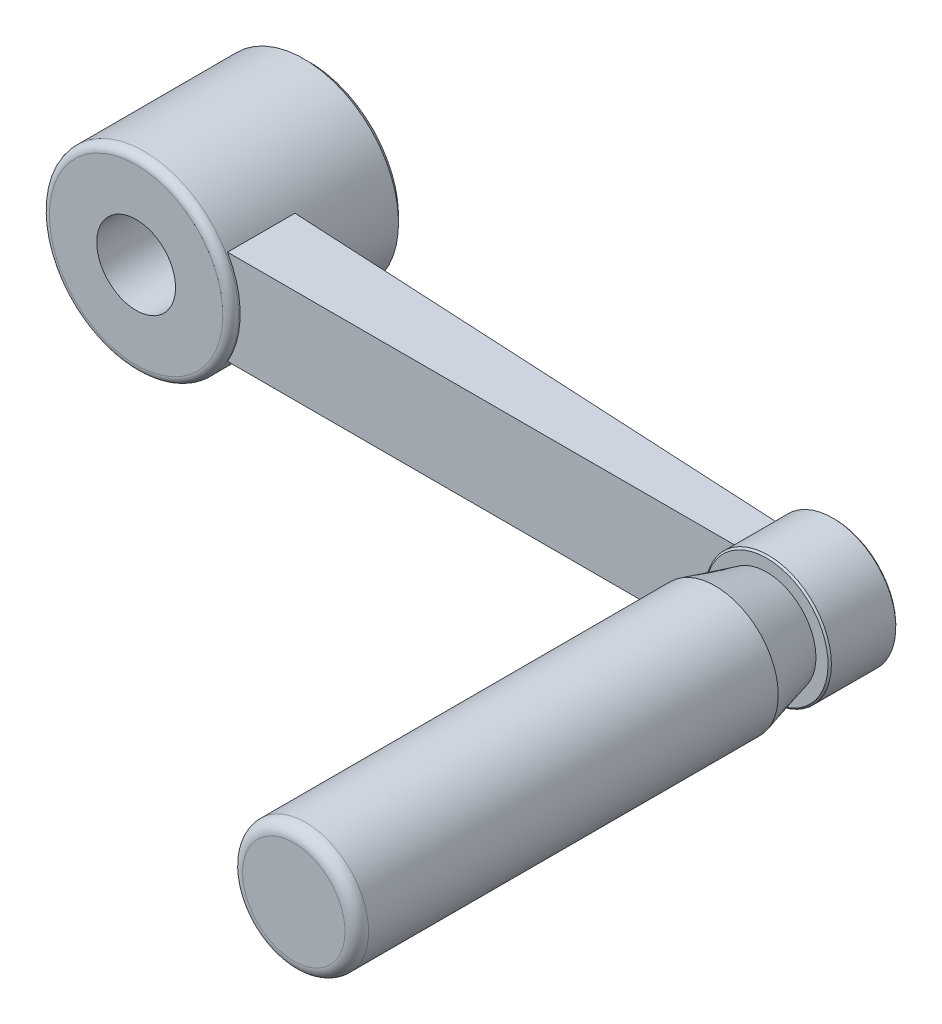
ISO-10303-21;
HEADER;
FILE_DESCRIPTION(('STEP AP214'),'2;1');
FILE_NAME('part.step','',(''),(''),'','','');
FILE_SCHEMA(('AUTOMOTIVE_DESIGN { 1 0 10303 214 1 1 1 1 }'));
ENDSEC;
DATA;
#1=APPLICATION_CONTEXT('core data for automotive mechanical design processes');
#2=APPLICATION_PROTOCOL_DEFINITION('international standard','automotive_design',2000,#1);
#3=PRODUCT_CONTEXT('',#1,'mechanical');
#4=PRODUCT('Part','Part','',(#3));
#5=PRODUCT_RELATED_PRODUCT_CATEGORY('part','',(#4));
#6=PRODUCT_DEFINITION_FORMATION('','',#4);
#7=PRODUCT_DEFINITION_CONTEXT('part definition',#1,'design');
#8=PRODUCT_DEFINITION('design','',#6,#7);
#9=PRODUCT_DEFINITION_SHAPE('','',#8);
#10=(LENGTH_UNIT() NAMED_UNIT(*) SI_UNIT(.MILLI.,.METRE.));
#11=(NAMED_UNIT(*) PLANE_ANGLE_UNIT() SI_UNIT($,.RADIAN.));
#12=(NAMED_UNIT(*) SI_UNIT($,.STERADIAN.) SOLID_ANGLE_UNIT());
#13=UNCERTAINTY_MEASURE_WITH_UNIT(LENGTH_MEASURE(1.E-05),#10,'distance_accuracy_value','');
#14=(GEOMETRIC_REPRESENTATION_CONTEXT(3) GLOBAL_UNCERTAINTY_ASSIGNED_CONTEXT((#13)) GLOBAL_UNIT_ASSIGNED_CONTEXT((#10,
#11,#12)) REPRESENTATION_CONTEXT('',''));
#15=CARTESIAN_POINT('',(0.,0.,0.));
#16=DIRECTION('',(0.,0.,1.));
#17=DIRECTION('',(1.,0.,0.));
#18=AXIS2_PLACEMENT_3D('',#15,#16,#17);
#19=CARTESIAN_POINT('',(82.0095,0.,14.));
#20=DIRECTION('',(0.,0.,1.));
#21=DIRECTION('',(0.,-1.,0.));
#22=AXIS2_PLACEMENT_3D('',#19,#20,#21);
#23=PLANE('',#22);
#24=CARTESIAN_POINT('',(80.,0.,14.00000000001));
#25=DIRECTION('',(0.,0.,1.));
#26=DIRECTION('',(-1.,0.,0.));
#27=AXIS2_PLACEMENT_3D('',#24,#25,#26);
#28=CIRCLE('',#27,2.00949999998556);
#29=CARTESIAN_POINT('',(77.9905000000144,0.,14.00000000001));
#30=VERTEX_POINT('',#29);
#31=EDGE_CURVE('E17',#30,#30,#28,.T.);
#32=ORIENTED_EDGE('',*,*,#31,.F.);
#33=EDGE_LOOP('',(#32));
#34=FACE_BOUND('',#33,.T.);
#35=ADVANCED_FACE('F14',(#34),#23,.F.);
#36=CARTESIAN_POINT('',(80.,0.,14.0574999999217));
#37=DIRECTION('',(0.,0.,1.));
#38=DIRECTION('',(-1.,0.,0.));
#39=AXIS2_PLACEMENT_3D('',#36,#37,#38);
#40=CONICAL_SURFACE('',#39,2.06699999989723,0.785398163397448);
#41=CARTESIAN_POINT('',(80.,0.,14.0575));
#42=DIRECTION('',(0.,0.,1.));
#43=DIRECTION('',(0.,-1.,0.));
#44=AXIS2_PLACEMENT_3D('',#41,#42,#43);
#45=CIRCLE('',#44,2.067);
#46=CARTESIAN_POINT('',(80.,-2.067,14.0575));
#47=VERTEX_POINT('',#46);
#48=EDGE_CURVE('E117',#47,#47,#45,.F.);
#49=ORIENTED_EDGE('',*,*,#48,.T.);
#50=EDGE_LOOP('',(#49));
#51=FACE_BOUND('',#50,.T.);
#52=ORIENTED_EDGE('',*,*,#31,.T.);
#53=EDGE_LOOP('',(#52));
#54=FACE_BOUND('',#53,.T.);
#55=ADVANCED_FACE('F429',(#51,#54),#40,.T.);
#56=CARTESIAN_POINT('',(0.,0.,0.));
#57=DIRECTION('',(0.,0.,1.));
#58=DIRECTION('',(0.,-1.,0.));
#59=AXIS2_PLACEMENT_3D('',#56,#57,#58);
#60=CYLINDRICAL_SURFACE('',#59,5.);
#61=CARTESIAN_POINT('',(0.,0.,22.));
#62=DIRECTION('',(0.,0.,1.));
#63=DIRECTION('',(0.,-1.,0.));
#64=AXIS2_PLACEMENT_3D('',#61,#62,#63);
#65=CIRCLE('',#64,5.);
#66=CARTESIAN_POINT('',(0.,-5.,22.));
#67=VERTEX_POINT('',#66);
#68=EDGE_CURVE('E152',#67,#67,#65,.T.);
#69=ORIENTED_EDGE('',*,*,#68,.T.);
#70=EDGE_LOOP('',(#69));
#71=FACE_BOUND('',#70,.T.);
#72=CARTESIAN_POINT('',(0.,0.,0.));
#73=DIRECTION('',(0.,0.,1.));
#74=DIRECTION('',(0.,-1.,0.));
#75=AXIS2_PLACEMENT_3D('',#72,#73,#74);
#76=CIRCLE('',#75,5.);
#77=CARTESIAN_POINT('',(0.,-5.,0.));
#78=VERTEX_POINT('',#77);
#79=EDGE_CURVE('E125',#78,#78,#76,.F.);
#80=ORIENTED_EDGE('',*,*,#79,.T.);
#81=EDGE_LOOP('',(#80));
#82=FACE_BOUND('',#81,.T.);
#83=ADVANCED_FACE('F157',(#71,#82),#60,.F.);
#84=CARTESIAN_POINT('',(80.,0.,13.4));
#85=DIRECTION('',(0.,0.,1.));
#86=DIRECTION('',(0.,-1.,0.));
#87=AXIS2_PLACEMENT_3D('',#84,#85,#86);
#88=CYLINDRICAL_SURFACE('',#87,2.067);
#89=ORIENTED_EDGE('',*,*,#48,.F.);
#90=EDGE_LOOP('',(#89));
#91=FACE_BOUND('',#90,.T.);
#92=CARTESIAN_POINT('',(80.,0.,13.8329999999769));
#93=DIRECTION('',(0.,0.,-1.));
#94=DIRECTION('',(0.,1.,0.));
#95=AXIS2_PLACEMENT_3D('',#92,#93,#94);
#96=CIRCLE('',#95,2.06699999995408);
#97=CARTESIAN_POINT('',(80.,2.06699999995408,13.8329999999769));
#98=VERTEX_POINT('',#97);
#99=EDGE_CURVE('E97',#98,#98,#96,.T.);
#100=ORIENTED_EDGE('',*,*,#99,.T.);
#101=EDGE_LOOP('',(#100));
#102=FACE_BOUND('',#101,.T.);
#103=ADVANCED_FACE('F162',(#91,#102),#88,.F.);
#104=CARTESIAN_POINT('',(11.2928932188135,0.,0.));
#105=DIRECTION('',(0.,0.,1.));
#106=DIRECTION('',(0.,-1.,0.));
#107=AXIS2_PLACEMENT_3D('',#104,#105,#106);
#108=PLANE('',#107);
#109=CARTESIAN_POINT('',(0.,0.,0.));
#110=DIRECTION('',(0.,0.,1.));
#111=DIRECTION('',(0.,-1.,0.));
#112=AXIS2_PLACEMENT_3D('',#109,#110,#111);
#113=CIRCLE('',#112,11.2928932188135);
#114=CARTESIAN_POINT('',(0.,-11.2928932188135,0.));
#115=VERTEX_POINT('',#114);
#116=EDGE_CURVE('E149',#115,#115,#113,.T.);
#117=ORIENTED_EDGE('',*,*,#116,.F.);
#118=EDGE_LOOP('',(#117));
#119=FACE_BOUND('',#118,.T.);
#120=ORIENTED_EDGE('',*,*,#79,.F.);
#121=EDGE_LOOP('',(#120));
#122=FACE_BOUND('',#121,.T.);
#123=ADVANCED_FACE('F159',(#119,#122),#108,.F.);
#124=CARTESIAN_POINT('',(0.,0.,22.));
#125=DIRECTION('',(0.,0.,-1.));
#126=DIRECTION('',(0.,1.,0.));
#127=AXIS2_PLACEMENT_3D('',#124,#125,#126);
#128=PLANE('',#127);
#129=ORIENTED_EDGE('',*,*,#68,.F.);
#130=EDGE_LOOP('',(#129));
#131=FACE_BOUND('',#130,.T.);
#132=CARTESIAN_POINT('',(0.,0.,22.));
#133=DIRECTION('',(0.,0.,-1.));
#134=DIRECTION('',(0.,1.,0.));
#135=AXIS2_PLACEMENT_3D('',#132,#133,#134);
#136=CIRCLE('',#135,11.);
#137=CARTESIAN_POINT('',(0.,11.,22.));
#138=VERTEX_POINT('',#137);
#139=EDGE_CURVE('E148',#138,#138,#136,.T.);
#140=ORIENTED_EDGE('',*,*,#139,.F.);
#141=EDGE_LOOP('',(#140));
#142=FACE_BOUND('',#141,.T.);
#143=ADVANCED_FACE('F161',(#131,#142),#128,.F.);
#144=CARTESIAN_POINT('',(80.,0.,13.4000000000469));
#145=DIRECTION('',(0.,0.,-1.));
#146=DIRECTION('',(1.,0.,0.));
#147=AXIS2_PLACEMENT_3D('',#144,#145,#146);
#148=CONICAL_SURFACE('',#147,2.49999999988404,0.78539816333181);
#149=ORIENTED_EDGE('',*,*,#99,.F.);
#150=EDGE_LOOP('',(#149));
#151=FACE_BOUND('',#150,.T.);
#152=CARTESIAN_POINT('',(80.,0.,13.3999999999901));
#153=DIRECTION('',(0.,0.,-1.));
#154=DIRECTION('',(1.,0.,0.));
#155=AXIS2_PLACEMENT_3D('',#152,#153,#154);
#156=CIRCLE('',#155,2.49999999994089);
#157=CARTESIAN_POINT('',(82.4999999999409,0.,13.3999999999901));
#158=VERTEX_POINT('',#157);
#159=EDGE_CURVE('E92',#158,#158,#156,.F.);
#160=ORIENTED_EDGE('',*,*,#159,.F.);
#161=EDGE_LOOP('',(#160));
#162=FACE_BOUND('',#161,.T.);
#163=ADVANCED_FACE('F170',(#151,#162),#148,.F.);
#164=CARTESIAN_POINT('',(0.,0.,0.707106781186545));
#165=DIRECTION('',(0.,0.,1.));
#166=DIRECTION('',(0.,-1.,0.));
#167=AXIS2_PLACEMENT_3D('',#164,#165,#166);
#168=CONICAL_SURFACE('',#167,12.,0.785398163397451);
#169=CARTESIAN_POINT('',(0.,0.,0.707106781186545));
#170=DIRECTION('',(0.,0.,1.));
#171=DIRECTION('',(0.,-1.,0.));
#172=AXIS2_PLACEMENT_3D('',#169,#170,#171);
#173=CIRCLE('',#172,12.);
#174=CARTESIAN_POINT('',(0.,-12.,0.707106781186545));
#175=VERTEX_POINT('',#174);
#176=EDGE_CURVE('E87',#175,#175,#173,.T.);
#177=ORIENTED_EDGE('',*,*,#176,.F.);
#178=EDGE_LOOP('',(#177));
#179=FACE_BOUND('',#178,.T.);
#180=ORIENTED_EDGE('',*,*,#116,.T.);
#181=EDGE_LOOP('',(#180));
#182=FACE_BOUND('',#181,.T.);
#183=ADVANCED_FACE('F106',(#179,#182),#168,.T.);
#184=CARTESIAN_POINT('',(0.,0.,21.));
#185=DIRECTION('',(0.,0.,-1.));
#186=DIRECTION('',(0.,1.,0.));
#187=AXIS2_PLACEMENT_3D('',#184,#185,#186);
#188=TOROIDAL_SURFACE('',#187,11.,1.);
#189=CARTESIAN_POINT('',(0.,0.,21.));
#190=DIRECTION('',(0.,0.,1.));
#191=DIRECTION('',(0.,-1.,0.));
#192=AXIS2_PLACEMENT_3D('',#189,#190,#191);
#193=CIRCLE('',#192,12.);
#194=CARTESIAN_POINT('',(0.,-12.,21.));
#195=VERTEX_POINT('',#194);
#196=EDGE_CURVE('E84',#195,#195,#193,.F.);
#197=ORIENTED_EDGE('',*,*,#196,.F.);
#198=EDGE_LOOP('',(#197));
#199=FACE_BOUND('',#198,.T.);
#200=ORIENTED_EDGE('',*,*,#139,.T.);
#201=EDGE_LOOP('',(#200));
#202=FACE_BOUND('',#201,.T.);
#203=ADVANCED_FACE('F100',(#199,#202),#188,.T.);
#204=CARTESIAN_POINT('',(82.5,0.,13.4));
#205=DIRECTION('',(0.,0.,-1.));
#206=DIRECTION('',(0.,1.,0.));
#207=AXIS2_PLACEMENT_3D('',#204,#205,#206);
#208=PLANE('',#207);
#209=ORIENTED_EDGE('',*,*,#159,.T.);
#210=EDGE_LOOP('',(#209));
#211=FACE_BOUND('',#210,.T.);
#212=CARTESIAN_POINT('',(80.,0.,13.4));
#213=DIRECTION('',(0.,0.,1.));
#214=DIRECTION('',(-1.,0.,0.));
#215=AXIS2_PLACEMENT_3D('',#212,#213,#214);
#216=CIRCLE('',#215,7.78786796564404);
#217=CARTESIAN_POINT('',(72.212132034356,0.,13.4));
#218=VERTEX_POINT('',#217);
#219=EDGE_CURVE('E63',#218,#218,#216,.T.);
#220=ORIENTED_EDGE('',*,*,#219,.F.);
#221=EDGE_LOOP('',(#220));
#222=FACE_BOUND('',#221,.T.);
#223=ADVANCED_FACE('F105',(#211,#222),#208,.T.);
#224=CARTESIAN_POINT('',(0.,0.,0.));
#225=DIRECTION('',(0.,0.,1.));
#226=DIRECTION('',(0.,-1.,0.));
#227=AXIS2_PLACEMENT_3D('',#224,#225,#226);
#228=CYLINDRICAL_SURFACE('',#227,12.);
#229=ORIENTED_EDGE('',*,*,#196,.T.);
#230=EDGE_LOOP('',(#229));
#231=FACE_BOUND('',#230,.T.);
#232=CARTESIAN_POINT('',(0.,0.,11.7));
#233=DIRECTION('',(-0.0523359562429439,0.,0.998629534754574));
#234=DIRECTION('',(0.998629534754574,0.,0.0523359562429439));
#235=AXIS2_PLACEMENT_3D('',#232,#233,#234);
#236=ELLIPSE('',#235,12.016468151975,12.);
#237=CARTESIAN_POINT('',(10.3923048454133,6.,12.2446376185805));
#238=VERTEX_POINT('',#237);
#239=CARTESIAN_POINT('',(10.3923048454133,-6.,12.2446376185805));
#240=VERTEX_POINT('',#239);
#241=EDGE_CURVE('E53',#238,#240,#236,.F.);
#242=ORIENTED_EDGE('',*,*,#241,.T.);
#243=DIRECTION('',(0.,0.,1.));
#244=VECTOR('',#243,1.);
#245=CARTESIAN_POINT('',(10.3923048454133,-6.,0.));
#246=LINE('',#245,#244);
#247=CARTESIAN_POINT('',(10.3923048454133,-6.,20.8));
#248=VERTEX_POINT('',#247);
#249=EDGE_CURVE('E82',#240,#248,#246,.T.);
#250=ORIENTED_EDGE('',*,*,#249,.T.);
#251=CARTESIAN_POINT('',(0.,0.,20.8));
#252=DIRECTION('',(0.,0.,1.));
#253=DIRECTION('',(0.,-1.,0.));
#254=AXIS2_PLACEMENT_3D('',#251,#252,#253);
#255=CIRCLE('',#254,12.);
#256=CARTESIAN_POINT('',(10.3923048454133,6.,20.8));
#257=VERTEX_POINT('',#256);
#258=EDGE_CURVE('E69',#248,#257,#255,.T.);
#259=ORIENTED_EDGE('',*,*,#258,.T.);
#260=DIRECTION('',(0.,0.,1.));
#261=VECTOR('',#260,1.);
#262=CARTESIAN_POINT('',(10.3923048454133,6.,0.));
#263=LINE('',#262,#261);
#264=EDGE_CURVE('E66',#238,#257,#263,.T.);
#265=ORIENTED_EDGE('',*,*,#264,.F.);
#266=EDGE_LOOP('',(#242,#250,#259,#265));
#267=FACE_BOUND('',#266,.T.);
#268=ORIENTED_EDGE('',*,*,#176,.T.);
#269=EDGE_LOOP('',(#268));
#270=FACE_BOUND('',#269,.T.);
#271=ADVANCED_FACE('F67',(#231,#267,#270),#228,.T.);
#272=CARTESIAN_POINT('',(80.,0.,13.612132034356));
#273=DIRECTION('',(0.,0.,1.));
#274=DIRECTION('',(-1.,0.,0.));
#275=AXIS2_PLACEMENT_3D('',#272,#273,#274);
#276=CONICAL_SURFACE('',#275,8.,0.785398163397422);
#277=ORIENTED_EDGE('',*,*,#219,.T.);
#278=EDGE_LOOP('',(#277));
#279=FACE_BOUND('',#278,.T.);
#280=CARTESIAN_POINT('',(80.,0.,13.612132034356));
#281=DIRECTION('',(0.,0.,1.));
#282=DIRECTION('',(0.,-1.,0.));
#283=AXIS2_PLACEMENT_3D('',#280,#281,#282);
#284=CIRCLE('',#283,8.);
#285=CARTESIAN_POINT('',(80.,-8.,13.612132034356));
#286=VERTEX_POINT('',#285);
#287=EDGE_CURVE('E142',#286,#286,#284,.T.);
#288=ORIENTED_EDGE('',*,*,#287,.F.);
#289=EDGE_LOOP('',(#288));
#290=FACE_BOUND('',#289,.T.);
#291=ADVANCED_FACE('F237',(#279,#290),#276,.T.);
#292=CARTESIAN_POINT('',(0.,-6.,11.7));
#293=DIRECTION('',(-0.0523359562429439,0.,0.998629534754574));
#294=DIRECTION('',(-0.998629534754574,0.,-0.0523359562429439));
#295=AXIS2_PLACEMENT_3D('',#292,#293,#294);
#296=PLANE('',#295);
#297=CARTESIAN_POINT('',(80.,0.,15.8926223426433));
#298=DIRECTION('',(-0.0523359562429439,0.,0.998629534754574));
#299=DIRECTION('',(0.998629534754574,0.,0.0523359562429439));
#300=AXIS2_PLACEMENT_3D('',#297,#298,#299);
#301=ELLIPSE('',#300,8.01097876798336,8.);
#302=CARTESIAN_POINT('',(74.7084973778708,-6.,15.6153064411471));
#303=VERTEX_POINT('',#302);
#304=CARTESIAN_POINT('',(74.7084973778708,6.,15.6153064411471));
#305=VERTEX_POINT('',#304);
#306=EDGE_CURVE('E140',#303,#305,#301,.F.);
#307=ORIENTED_EDGE('',*,*,#306,.F.);
#308=DIRECTION('',(-0.998629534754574,0.,-0.0523359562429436));
#309=VECTOR('',#308,1.);
#310=CARTESIAN_POINT('',(74.7084973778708,-6.,15.6153064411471));
#311=LINE('',#310,#309);
#312=EDGE_CURVE('E60',#303,#240,#311,.T.);
#313=ORIENTED_EDGE('',*,*,#312,.T.);
#314=ORIENTED_EDGE('',*,*,#241,.F.);
#315=DIRECTION('',(-0.998629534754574,0.,-0.0523359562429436));
#316=VECTOR('',#315,1.);
#317=CARTESIAN_POINT('',(74.7084973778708,6.,15.6153064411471));
#318=LINE('',#317,#316);
#319=EDGE_CURVE('E57',#305,#238,#318,.T.);
#320=ORIENTED_EDGE('',*,*,#319,.F.);
#321=EDGE_LOOP('',(#307,#313,#314,#320));
#322=FACE_BOUND('',#321,.T.);
#323=ADVANCED_FACE('F55',(#322),#296,.F.);
#324=CARTESIAN_POINT('',(0.,6.,0.));
#325=DIRECTION('',(0.,1.,0.));
#326=DIRECTION('',(-1.,0.,0.));
#327=AXIS2_PLACEMENT_3D('',#324,#325,#326);
#328=PLANE('',#327);
#329=ORIENTED_EDGE('',*,*,#264,.T.);
#330=DIRECTION('',(1.,0.,0.));
#331=VECTOR('',#330,1.);
#332=CARTESIAN_POINT('',(76.5,6.,20.8));
#333=LINE('',#332,#331);
#334=CARTESIAN_POINT('',(74.7084973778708,6.,20.8));
#335=VERTEX_POINT('',#334);
#336=EDGE_CURVE('E80',#257,#335,#333,.T.);
#337=ORIENTED_EDGE('',*,*,#336,.T.);
#338=DIRECTION('',(0.,0.,1.));
#339=VECTOR('',#338,1.);
#340=CARTESIAN_POINT('',(74.7084973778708,6.,13.4));
#341=LINE('',#340,#339);
#342=EDGE_CURVE('E75',#305,#335,#341,.T.);
#343=ORIENTED_EDGE('',*,*,#342,.F.);
#344=ORIENTED_EDGE('',*,*,#319,.T.);
#345=EDGE_LOOP('',(#329,#337,#343,#344));
#346=FACE_BOUND('',#345,.T.);
#347=ADVANCED_FACE('F73',(#346),#328,.T.);
#348=CARTESIAN_POINT('',(76.5,-6.,20.8));
#349=DIRECTION('',(0.,0.,-1.));
#350=DIRECTION('',(0.,1.,0.));
#351=AXIS2_PLACEMENT_3D('',#348,#349,#350);
#352=PLANE('',#351);
#353=CARTESIAN_POINT('',(80.,0.,20.8));
#354=DIRECTION('',(0.,0.,1.));
#355=DIRECTION('',(0.,-1.,0.));
#356=AXIS2_PLACEMENT_3D('',#353,#354,#355);
#357=CIRCLE('',#356,8.);
#358=CARTESIAN_POINT('',(74.7084973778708,-6.,20.8));
#359=VERTEX_POINT('',#358);
#360=EDGE_CURVE('E136',#335,#359,#357,.T.);
#361=ORIENTED_EDGE('',*,*,#360,.F.);
#362=ORIENTED_EDGE('',*,*,#336,.F.);
#363=ORIENTED_EDGE('',*,*,#258,.F.);
#364=DIRECTION('',(-1.,0.,0.));
#365=VECTOR('',#364,1.);
#366=CARTESIAN_POINT('',(0.,-6.,20.8));
#367=LINE('',#366,#365);
#368=EDGE_CURVE('E32',#248,#359,#367,.F.);
#369=ORIENTED_EDGE('',*,*,#368,.T.);
#370=EDGE_LOOP('',(#361,#362,#363,#369));
#371=FACE_BOUND('',#370,.T.);
#372=ADVANCED_FACE('F229',(#371),#352,.F.);
#373=CARTESIAN_POINT('',(0.,-6.,0.));
#374=DIRECTION('',(0.,1.,0.));
#375=DIRECTION('',(-1.,0.,0.));
#376=AXIS2_PLACEMENT_3D('',#373,#374,#375);
#377=PLANE('',#376);
#378=DIRECTION('',(0.,0.,1.));
#379=VECTOR('',#378,1.);
#380=CARTESIAN_POINT('',(74.7084973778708,-6.,13.4));
#381=LINE('',#380,#379);
#382=EDGE_CURVE('E139',#359,#303,#381,.F.);
#383=ORIENTED_EDGE('',*,*,#382,.F.);
#384=ORIENTED_EDGE('',*,*,#368,.F.);
#385=ORIENTED_EDGE('',*,*,#249,.F.);
#386=ORIENTED_EDGE('',*,*,#312,.F.);
#387=EDGE_LOOP('',(#383,#384,#385,#386));
#388=FACE_BOUND('',#387,.T.);
#389=ADVANCED_FACE('F225',(#388),#377,.F.);
#390=CARTESIAN_POINT('',(80.,0.,13.4));
#391=DIRECTION('',(0.,0.,1.));
#392=DIRECTION('',(0.,-1.,0.));
#393=AXIS2_PLACEMENT_3D('',#390,#391,#392);
#394=CYLINDRICAL_SURFACE('',#393,8.);
#395=ORIENTED_EDGE('',*,*,#360,.T.);
#396=ORIENTED_EDGE('',*,*,#382,.T.);
#397=ORIENTED_EDGE('',*,*,#306,.T.);
#398=ORIENTED_EDGE('',*,*,#342,.T.);
#399=EDGE_LOOP('',(#395,#396,#397,#398));
#400=FACE_BOUND('',#399,.T.);
#401=ORIENTED_EDGE('',*,*,#287,.T.);
#402=EDGE_LOOP('',(#401));
#403=FACE_BOUND('',#402,.T.);
#404=CARTESIAN_POINT('',(80.,0.,21.787867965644));
#405=DIRECTION('',(0.,0.,-1.));
#406=DIRECTION('',(0.,1.,0.));
#407=AXIS2_PLACEMENT_3D('',#404,#405,#406);
#408=CIRCLE('',#407,8.);
#409=CARTESIAN_POINT('',(80.,8.,21.787867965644));
#410=VERTEX_POINT('',#409);
#411=EDGE_CURVE('E135',#410,#410,#408,.F.);
#412=ORIENTED_EDGE('',*,*,#411,.F.);
#413=EDGE_LOOP('',(#412));
#414=FACE_BOUND('',#413,.T.);
#415=ADVANCED_FACE('F221',(#400,#403,#414),#394,.T.);
#416=CARTESIAN_POINT('',(80.,0.,21.787867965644));
#417=DIRECTION('',(0.,0.,-1.));
#418=DIRECTION('',(0.,1.,0.));
#419=AXIS2_PLACEMENT_3D('',#416,#417,#418);
#420=CONICAL_SURFACE('',#419,8.,0.785398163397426);
#421=ORIENTED_EDGE('',*,*,#411,.T.);
#422=EDGE_LOOP('',(#421));
#423=FACE_BOUND('',#422,.T.);
#424=CARTESIAN_POINT('',(80.,0.,22.));
#425=DIRECTION('',(0.,0.,-1.));
#426=DIRECTION('',(0.,1.,0.));
#427=AXIS2_PLACEMENT_3D('',#424,#425,#426);
#428=CIRCLE('',#427,7.78786796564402);
#429=CARTESIAN_POINT('',(80.,7.78786796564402,22.));
#430=VERTEX_POINT('',#429);
#431=EDGE_CURVE('E132',#430,#430,#428,.F.);
#432=ORIENTED_EDGE('',*,*,#431,.F.);
#433=EDGE_LOOP('',(#432));
#434=FACE_BOUND('',#433,.T.);
#435=ADVANCED_FACE('F217',(#423,#434),#420,.T.);
#436=CARTESIAN_POINT('',(87.787867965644,0.,22.));
#437=DIRECTION('',(0.,0.,1.));
#438=DIRECTION('',(0.,-1.,0.));
#439=AXIS2_PLACEMENT_3D('',#436,#437,#438);
#440=PLANE('',#439);
#441=ORIENTED_EDGE('',*,*,#431,.T.);
#442=EDGE_LOOP('',(#441));
#443=FACE_BOUND('',#442,.T.);
#444=CARTESIAN_POINT('',(80.,0.,22.));
#445=DIRECTION('',(0.,0.,1.));
#446=DIRECTION('',(0.,-1.,0.));
#447=AXIS2_PLACEMENT_3D('',#444,#445,#446);
#448=CIRCLE('',#447,6.25);
#449=CARTESIAN_POINT('',(80.,-6.25,22.));
#450=VERTEX_POINT('',#449);
#451=EDGE_CURVE('E128',#450,#450,#448,.T.);
#452=ORIENTED_EDGE('',*,*,#451,.F.);
#453=EDGE_LOOP('',(#452));
#454=FACE_BOUND('',#453,.T.);
#455=ADVANCED_FACE('F214',(#443,#454),#440,.T.);
#456=CARTESIAN_POINT('',(80.,0.,82.));
#457=DIRECTION('',(0.,0.,-1.));
#458=DIRECTION('',(0.,1.,0.));
#459=AXIS2_PLACEMENT_3D('',#456,#457,#458);
#460=PLANE('',#459);
#461=CARTESIAN_POINT('',(80.,0.,82.));
#462=DIRECTION('',(0.,0.,-1.));
#463=DIRECTION('',(0.,1.,0.));
#464=AXIS2_PLACEMENT_3D('',#461,#462,#463);
#465=CIRCLE('',#464,6.50000000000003);
#466=CARTESIAN_POINT('',(80.,6.50000000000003,82.));
#467=VERTEX_POINT('',#466);
#468=EDGE_CURVE('E131',#467,#467,#465,.T.);
#469=ORIENTED_EDGE('',*,*,#468,.F.);
#470=EDGE_LOOP('',(#469));
#471=FACE_BOUND('',#470,.T.);
#472=ADVANCED_FACE('F205',(#471),#460,.F.);
#473=CARTESIAN_POINT('',(80.,0.,28.5310889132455));
#474=DIRECTION('',(0.,0.,1.));
#475=DIRECTION('',(0.,-1.,0.));
#476=AXIS2_PLACEMENT_3D('',#473,#474,#475);
#477=CONICAL_SURFACE('',#476,8.,0.261799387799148);
#478=CARTESIAN_POINT('',(80.,0.,28.5310889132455));
#479=DIRECTION('',(0.,0.,1.));
#480=DIRECTION('',(0.,-1.,0.));
#481=AXIS2_PLACEMENT_3D('',#478,#479,#480);
#482=CIRCLE('',#481,8.);
#483=CARTESIAN_POINT('',(80.,-8.,28.5310889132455));
#484=VERTEX_POINT('',#483);
#485=EDGE_CURVE('E23',#484,#484,#482,.T.);
#486=ORIENTED_EDGE('',*,*,#485,.F.);
#487=EDGE_LOOP('',(#486));
#488=FACE_BOUND('',#487,.T.);
#489=ORIENTED_EDGE('',*,*,#451,.T.);
#490=EDGE_LOOP('',(#489));
#491=FACE_BOUND('',#490,.T.);
#492=ADVANCED_FACE('F184',(#488,#491),#477,.T.);
#493=CARTESIAN_POINT('',(80.,0.,80.5));
#494=DIRECTION('',(0.,0.,-1.));
#495=DIRECTION('',(0.,1.,0.));
#496=AXIS2_PLACEMENT_3D('',#493,#494,#495);
#497=TOROIDAL_SURFACE('',#496,6.5,1.5);
#498=CARTESIAN_POINT('',(80.,0.,80.5));
#499=DIRECTION('',(0.,0.,1.));
#500=DIRECTION('',(0.,-1.,0.));
#501=AXIS2_PLACEMENT_3D('',#498,#499,#500);
#502=CIRCLE('',#501,8.);
#503=CARTESIAN_POINT('',(80.,-8.,80.5));
#504=VERTEX_POINT('',#503);
#505=EDGE_CURVE('E9',#504,#504,#502,.F.);
#506=ORIENTED_EDGE('',*,*,#505,.F.);
#507=EDGE_LOOP('',(#506));
#508=FACE_BOUND('',#507,.T.);
#509=ORIENTED_EDGE('',*,*,#468,.T.);
#510=EDGE_LOOP('',(#509));
#511=FACE_BOUND('',#510,.T.);
#512=ADVANCED_FACE('F178',(#508,#511),#497,.T.);
#513=CARTESIAN_POINT('',(80.,0.,14.));
#514=DIRECTION('',(0.,0.,1.));
#515=DIRECTION('',(0.,-1.,0.));
#516=AXIS2_PLACEMENT_3D('',#513,#514,#515);
#517=CYLINDRICAL_SURFACE('',#516,8.);
#518=ORIENTED_EDGE('',*,*,#505,.T.);
#519=EDGE_LOOP('',(#518));
#520=FACE_BOUND('',#519,.T.);
#521=ORIENTED_EDGE('',*,*,#485,.T.);
#522=EDGE_LOOP('',(#521));
#523=FACE_BOUND('',#522,.T.);
#524=ADVANCED_FACE('F176',(#520,#523),#517,.T.);
#525=CLOSED_SHELL('',(#35,#55,#83,#103,#123,#143,#163,#183,#203,#223,#271,#291,#323,#347,#372,
#389,#415,#435,#455,#472,#492,#512,#524));
#526=MANIFOLD_SOLID_BREP('B1',#525);
#527=ADVANCED_BREP_SHAPE_REPRESENTATION('',(#18,#526),#14);
#528=SHAPE_DEFINITION_REPRESENTATION(#9,#527);
ENDSEC;
END-ISO-10303-21;
